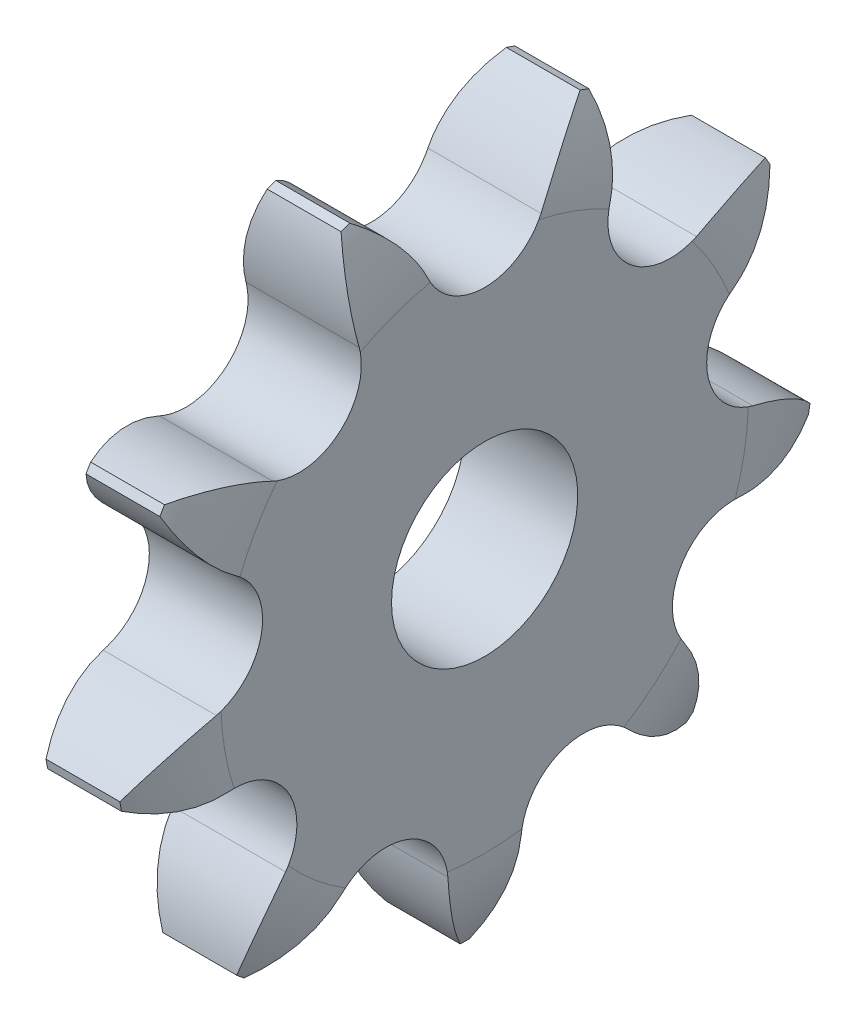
from build123d import *

# Parameters (mm, degrees)
TOOTHCUT_DEPTH  = 33.685942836
TEETHCUTS_COUNT = 9
TEETHCUTS_ANGLE = 320
BORSKE_R        = 6
BORE_DEPTH      = 9.5005


with BuildPart() as part:
    # BasProSke → Base-Revolve (revolve)
    with BuildSketch(Plane(origin=(0, 0, 0), x_dir=(1, 0, 0), z_dir=(0, 1, 0)), mode=Mode.PRIVATE) as base_revolve_sk:
        with BuildLine():
            Line((0, 0), (0, 16.992856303))
            ThreePointArc((0, 16.992856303), (0.321571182, 19.832662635), (1.27, 22.528657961))
            Line((1.27, 22.528657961), (6.03, 22.528657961))
            ThreePointArc((6.03, 22.528657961), (6.978428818, 19.832662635), (7.3, 16.992856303))
            Line((7.3, 16.992856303), (7.3, 0))
            Line((7.3, 0), (0, 0))
        make_face()
    revolve(base_revolve_sk.sketch.rotate(Axis((-10, 0, 0), (1, 0, 0)), 180), axis=Axis((-10, 0, 0), (1, 0, 0)))

    # TooCutSke → ToothCut (cut, through all)
    with BuildSketch(Plane(origin=(0, 0, 0), x_dir=(0, 0, -1), z_dir=(1, 0, 0))):
        with BuildLine():
            ThreePointArc((3.638599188, 16.909201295), (5.440645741, 19.594585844), (7.97480479, 21.603739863))
            ThreePointArc((7.97480479, 21.603739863), (0, 23.028657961), (-7.97480479, 21.603739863))
            ThreePointArc((-7.97480479, 21.603739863), (-5.440645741, 19.594585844), (-3.638599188, 16.909201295))
            ThreePointArc((-3.638599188, 16.909201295), (0, 14.591157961), (3.638599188, 16.909201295))
        make_face()
    toothcut = extrude(amount=TOOTHCUT_DEPTH, mode=Mode.SUBTRACT)

    # TeethCuts: ToothCut ×9 about axis
    teethcuts_axis = Axis((-10, 0, 0), (1, 0, 0))
    for i in range(1, TEETHCUTS_COUNT):
        add(toothcut.rotate(teethcuts_axis, i * TEETHCUTS_ANGLE / (TEETHCUTS_COUNT - 1)), mode=Mode.SUBTRACT)

    # BorSke → Bore (cut, symmetric)
    with BuildSketch(Plane(origin=(0, 0, 0), x_dir=(0, 0, -1), z_dir=(1, 0, 0))):
        with Locations(Location((0, 0, 0), (0, 0, 180))):
            Circle(BORSKE_R)
    extrude(amount=BORE_DEPTH, both=True, mode=Mode.SUBTRACT)


solid = part.part
